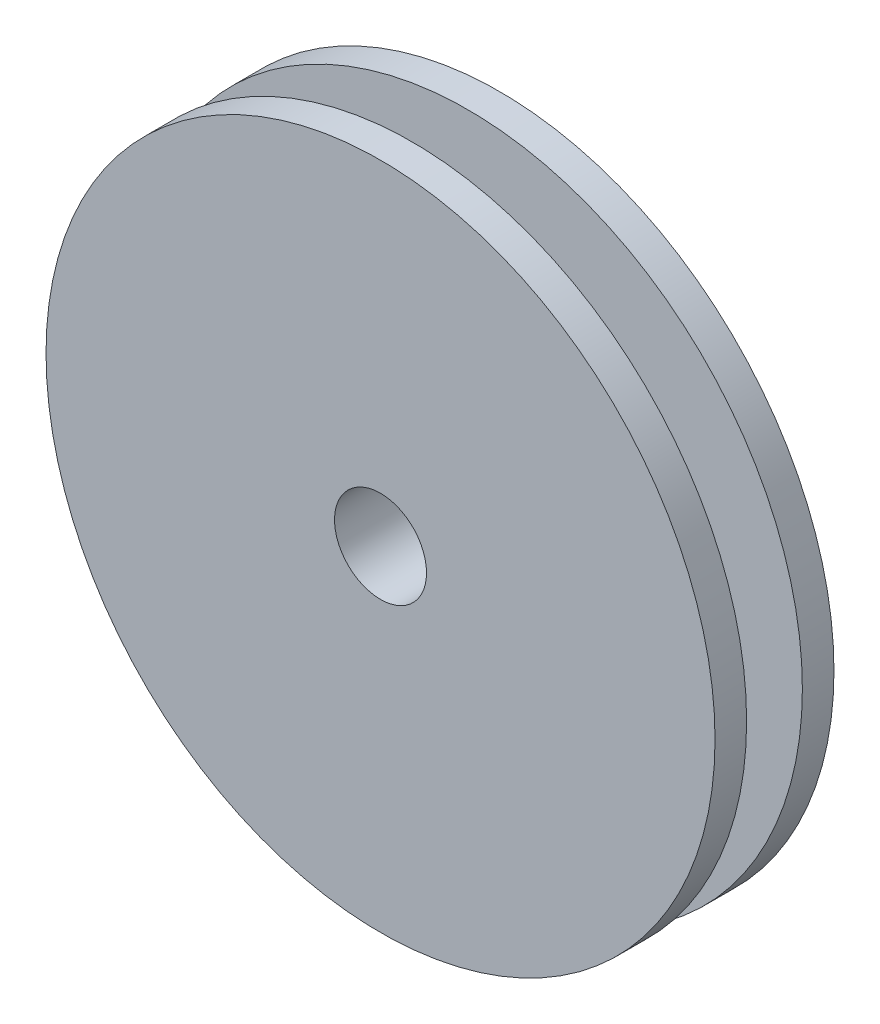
from build123d import *

# Parameters (mm, degrees)
SKETCH1_R               = 18
BOSS_EXTRUDE1_DEPTH     = 6.4
CUT_EXTRUDE1_DEPTH      = 17
CUT_EXTRUDE1_DEPTH_BACK = 43
SKETCH2_R               = 2.475
SKETCH5_R               = 18
SKETCH5_R_2             = 13
CUT_EXTRUDE4_DEPTH      = 1.5


with BuildPart() as part:
    # Sketch1 → Boss-Extrude1 (new body)
    with BuildSketch(Plane.XY.offset(30)):
        Circle(SKETCH1_R)
    extrude(amount=BOSS_EXTRUDE1_DEPTH)

    # Sketch2 → Cut-Extrude1 (cut, two sides: drawn at the far end of the back side and taken through both)
    with BuildSketch(Plane.XY.offset(36.4).offset(-CUT_EXTRUDE1_DEPTH_BACK)):
        Circle(SKETCH2_R)
    extrude(amount=CUT_EXTRUDE1_DEPTH + CUT_EXTRUDE1_DEPTH_BACK, mode=Mode.SUBTRACT)

    # Sketch5 → Cut-Extrude4 (cut, symmetric)
    with BuildSketch(Plane.XY.offset(33.2)):
        Circle(SKETCH5_R)
        Circle(SKETCH5_R_2, mode=Mode.SUBTRACT)
    extrude(amount=CUT_EXTRUDE4_DEPTH, both=True, mode=Mode.SUBTRACT)


solid = part.part
